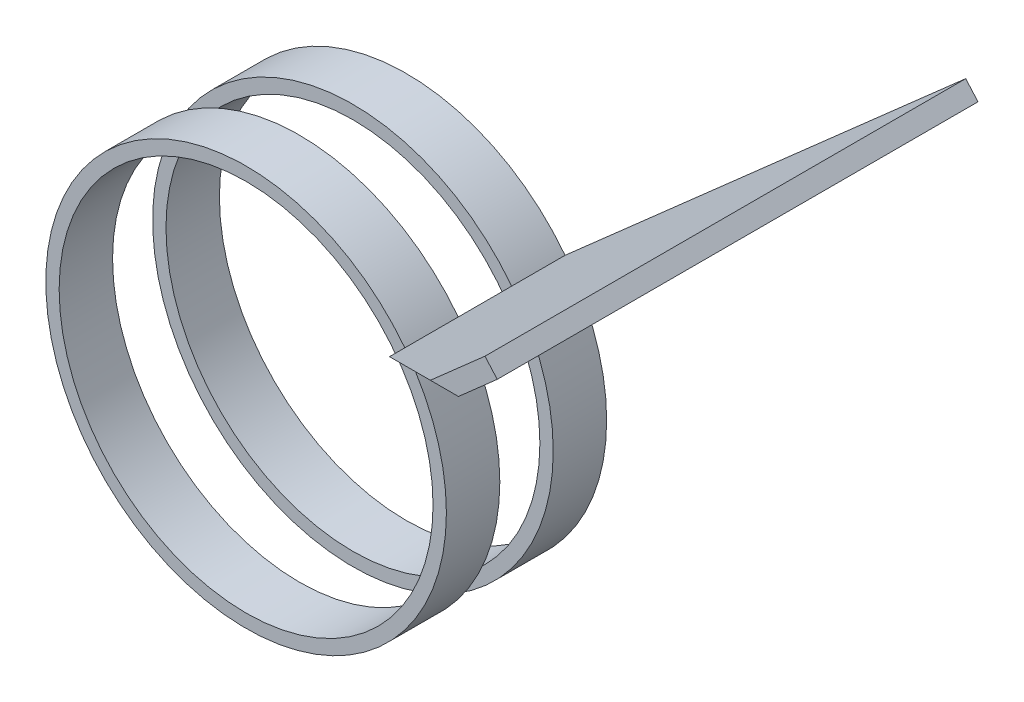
ISO-10303-21;
HEADER;
FILE_DESCRIPTION(('STEP AP214'),'2;1');
FILE_NAME('part.step','',(''),(''),'','','');
FILE_SCHEMA(('AUTOMOTIVE_DESIGN { 1 0 10303 214 1 1 1 1 }'));
ENDSEC;
DATA;
#1=APPLICATION_CONTEXT('core data for automotive mechanical design processes');
#2=APPLICATION_PROTOCOL_DEFINITION('international standard','automotive_design',2000,#1);
#3=PRODUCT_CONTEXT('',#1,'mechanical');
#4=PRODUCT('Part','Part','',(#3));
#5=PRODUCT_RELATED_PRODUCT_CATEGORY('part','',(#4));
#6=PRODUCT_DEFINITION_FORMATION('','',#4);
#7=PRODUCT_DEFINITION_CONTEXT('part definition',#1,'design');
#8=PRODUCT_DEFINITION('design','',#6,#7);
#9=PRODUCT_DEFINITION_SHAPE('','',#8);
#10=(LENGTH_UNIT() NAMED_UNIT(*) SI_UNIT(.MILLI.,.METRE.));
#11=(NAMED_UNIT(*) PLANE_ANGLE_UNIT() SI_UNIT($,.RADIAN.));
#12=(NAMED_UNIT(*) SI_UNIT($,.STERADIAN.) SOLID_ANGLE_UNIT());
#13=UNCERTAINTY_MEASURE_WITH_UNIT(LENGTH_MEASURE(1.E-05),#10,'distance_accuracy_value','');
#14=(GEOMETRIC_REPRESENTATION_CONTEXT(3) GLOBAL_UNCERTAINTY_ASSIGNED_CONTEXT((#13)) GLOBAL_UNIT_ASSIGNED_CONTEXT((#10,
#11,#12)) REPRESENTATION_CONTEXT('',''));
#15=CARTESIAN_POINT('',(0.,0.,0.));
#16=DIRECTION('',(0.,0.,1.));
#17=DIRECTION('',(1.,0.,0.));
#18=AXIS2_PLACEMENT_3D('',#15,#16,#17);
#19=CARTESIAN_POINT('',(0.,0.,10.));
#20=DIRECTION('',(0.,0.,-1.));
#21=DIRECTION('',(-1.,0.,0.));
#22=AXIS2_PLACEMENT_3D('',#19,#20,#21);
#23=CYLINDRICAL_SURFACE('',#22,37.5);
#24=CARTESIAN_POINT('',(0.,0.,10.));
#25=DIRECTION('',(0.,0.,1.));
#26=DIRECTION('',(1.,0.,0.));
#27=AXIS2_PLACEMENT_3D('',#24,#25,#26);
#28=CIRCLE('',#27,37.5);
#29=CARTESIAN_POINT('',(29.7186463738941,22.8703313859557,10.));
#30=VERTEX_POINT('',#29);
#31=CARTESIAN_POINT('',(31.7214438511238,20.,10.));
#32=VERTEX_POINT('',#31);
#33=EDGE_CURVE('E189',#30,#32,#28,.T.);
#34=ORIENTED_EDGE('',*,*,#33,.F.);
#35=DIRECTION('',(0.,0.,1.));
#36=VECTOR('',#35,1.);
#37=CARTESIAN_POINT('',(29.7186463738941,22.8703313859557,-50.));
#38=LINE('',#37,#36);
#39=CARTESIAN_POINT('',(29.7186463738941,22.8703313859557,0.));
#40=VERTEX_POINT('',#39);
#41=EDGE_CURVE('E170',#40,#30,#38,.T.);
#42=ORIENTED_EDGE('',*,*,#41,.F.);
#43=CARTESIAN_POINT('',(0.,0.,0.));
#44=DIRECTION('',(0.,0.,1.));
#45=DIRECTION('',(1.,0.,0.));
#46=AXIS2_PLACEMENT_3D('',#43,#44,#45);
#47=CIRCLE('',#46,37.5);
#48=CARTESIAN_POINT('',(31.7214438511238,20.,0.));
#49=VERTEX_POINT('',#48);
#50=EDGE_CURVE('E185',#40,#49,#47,.T.);
#51=ORIENTED_EDGE('',*,*,#50,.T.);
#52=DIRECTION('',(0.,0.,1.));
#53=VECTOR('',#52,1.);
#54=CARTESIAN_POINT('',(31.7214438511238,20.,-50.));
#55=LINE('',#54,#53);
#56=EDGE_CURVE('E108',#49,#32,#55,.T.);
#57=ORIENTED_EDGE('',*,*,#56,.T.);
#58=EDGE_LOOP('',(#34,#42,#51,#57));
#59=FACE_BOUND('',#58,.T.);
#60=ADVANCED_FACE('F39',(#59),#23,.T.);
#61=CARTESIAN_POINT('',(0.,0.,10.));
#62=DIRECTION('',(0.,0.,1.));
#63=DIRECTION('',(1.,0.,0.));
#64=AXIS2_PLACEMENT_3D('',#61,#62,#63);
#65=PLANE('',#64);
#66=CARTESIAN_POINT('',(0.,0.,10.));
#67=DIRECTION('',(0.,0.,1.));
#68=DIRECTION('',(1.,0.,0.));
#69=AXIS2_PLACEMENT_3D('',#66,#67,#68);
#70=CIRCLE('',#69,35.);
#71=CARTESIAN_POINT('',(35.,0.,10.));
#72=VERTEX_POINT('',#71);
#73=EDGE_CURVE('E180',#72,#72,#70,.T.);
#74=ORIENTED_EDGE('',*,*,#73,.F.);
#75=EDGE_LOOP('',(#74));
#76=FACE_BOUND('',#75,.T.);
#77=DIRECTION('',(0.572227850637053,-0.820094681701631,0.));
#78=VECTOR('',#77,1.);
#79=CARTESIAN_POINT('',(30.720045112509,21.4351656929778,10.));
#80=LINE('',#79,#78);
#81=EDGE_CURVE('E169',#30,#32,#80,.T.);
#82=ORIENTED_EDGE('',*,*,#81,.F.);
#83=ORIENTED_EDGE('',*,*,#33,.T.);
#84=EDGE_LOOP('',(#82,#83));
#85=FACE_BOUND('',#84,.T.);
#86=ADVANCED_FACE('F226',(#76,#85),#65,.T.);
#87=CARTESIAN_POINT('',(0.,0.,0.));
#88=DIRECTION('',(0.,0.,1.));
#89=DIRECTION('',(1.,0.,0.));
#90=AXIS2_PLACEMENT_3D('',#87,#88,#89);
#91=PLANE('',#90);
#92=CARTESIAN_POINT('',(0.,0.,0.));
#93=DIRECTION('',(0.,0.,1.));
#94=DIRECTION('',(1.,0.,0.));
#95=AXIS2_PLACEMENT_3D('',#92,#93,#94);
#96=CIRCLE('',#95,35.);
#97=CARTESIAN_POINT('',(35.,0.,0.));
#98=VERTEX_POINT('',#97);
#99=EDGE_CURVE('E181',#98,#98,#96,.T.);
#100=ORIENTED_EDGE('',*,*,#99,.T.);
#101=EDGE_LOOP('',(#100));
#102=FACE_BOUND('',#101,.T.);
#103=ORIENTED_EDGE('',*,*,#50,.F.);
#104=DIRECTION('',(0.572227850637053,-0.820094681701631,0.));
#105=VECTOR('',#104,1.);
#106=CARTESIAN_POINT('',(30.720045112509,21.4351656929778,0.));
#107=LINE('',#106,#105);
#108=EDGE_CURVE('E193',#40,#49,#107,.T.);
#109=ORIENTED_EDGE('',*,*,#108,.T.);
#110=EDGE_LOOP('',(#103,#109));
#111=FACE_BOUND('',#110,.T.);
#112=ADVANCED_FACE('F228',(#102,#111),#91,.F.);
#113=CARTESIAN_POINT('',(0.,0.,0.));
#114=DIRECTION('',(0.,0.,1.));
#115=DIRECTION('',(1.,0.,0.));
#116=AXIS2_PLACEMENT_3D('',#113,#114,#115);
#117=CYLINDRICAL_SURFACE('',#116,35.);
#118=ORIENTED_EDGE('',*,*,#99,.F.);
#119=EDGE_LOOP('',(#118));
#120=FACE_BOUND('',#119,.T.);
#121=ORIENTED_EDGE('',*,*,#73,.T.);
#122=EDGE_LOOP('',(#121));
#123=FACE_BOUND('',#122,.T.);
#124=ADVANCED_FACE('F235',(#120,#123),#117,.F.);
#125=CARTESIAN_POINT('',(31.7214438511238,20.,-50.));
#126=DIRECTION('',(-0.82009468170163,-0.572227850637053,0.));
#127=DIRECTION('',(0.572227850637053,-0.820094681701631,0.));
#128=AXIS2_PLACEMENT_3D('',#125,#126,#127);
#129=PLANE('',#128);
#130=DIRECTION('',(-0.572227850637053,0.820094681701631,0.));
#131=VECTOR('',#130,1.);
#132=CARTESIAN_POINT('',(31.7214438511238,20.,-10.));
#133=LINE('',#132,#131);
#134=CARTESIAN_POINT('',(31.7214438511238,20.,-10.));
#135=VERTEX_POINT('',#134);
#136=CARTESIAN_POINT('',(29.7186463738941,22.8703313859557,-10.));
#137=VERTEX_POINT('',#136);
#138=EDGE_CURVE('E113',#135,#137,#133,.T.);
#139=ORIENTED_EDGE('',*,*,#138,.F.);
#140=EDGE_CURVE('E101',#135,#49,#55,.T.);
#141=ORIENTED_EDGE('',*,*,#140,.T.);
#142=ORIENTED_EDGE('',*,*,#108,.F.);
#143=EDGE_CURVE('E54',#137,#40,#38,.T.);
#144=ORIENTED_EDGE('',*,*,#143,.F.);
#145=EDGE_LOOP('',(#139,#141,#142,#144));
#146=FACE_BOUND('',#145,.T.);
#147=ADVANCED_FACE('F114',(#146),#129,.T.);
#148=DIRECTION('',(0.442464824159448,-0.634123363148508,-0.634123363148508));
#149=VECTOR('',#148,1.);
#150=CARTESIAN_POINT('',(48.556080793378,-4.12674638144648,-14.1267463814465));
#151=LINE('',#150,#149);
#152=CARTESIAN_POINT('',(29.7186463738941,22.8703313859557,12.8703313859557));
#153=VERTEX_POINT('',#152);
#154=EDGE_CURVE('E148',#153,#32,#151,.T.);
#155=ORIENTED_EDGE('',*,*,#154,.F.);
#156=EDGE_CURVE('E174',#30,#153,#38,.T.);
#157=ORIENTED_EDGE('',*,*,#156,.F.);
#158=ORIENTED_EDGE('',*,*,#81,.T.);
#159=EDGE_LOOP('',(#155,#157,#158));
#160=FACE_BOUND('',#159,.T.);
#161=ADVANCED_FACE('F218',(#160),#129,.T.);
#162=CARTESIAN_POINT('',(29.7186463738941,22.8703313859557,-50.));
#163=DIRECTION('',(-0.661437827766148,0.75,0.));
#164=DIRECTION('',(-0.75,-0.661437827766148,0.));
#165=AXIS2_PLACEMENT_3D('',#162,#163,#164);
#166=PLANE('',#165);
#167=DIRECTION('',(0.75,0.661437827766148,0.));
#168=VECTOR('',#167,1.);
#169=CARTESIAN_POINT('',(29.7186463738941,22.8703313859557,-20.));
#170=LINE('',#169,#168);
#171=CARTESIAN_POINT('',(29.7186463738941,22.8703313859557,-20.));
#172=VERTEX_POINT('',#171);
#173=CARTESIAN_POINT('',(104.718646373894,89.0141141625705,-20.));
#174=VERTEX_POINT('',#173);
#175=EDGE_CURVE('E142',#172,#174,#170,.T.);
#176=ORIENTED_EDGE('',*,*,#175,.F.);
#177=EDGE_CURVE('E166',#172,#137,#38,.T.);
#178=ORIENTED_EDGE('',*,*,#177,.T.);
#179=ORIENTED_EDGE('',*,*,#143,.T.);
#180=ORIENTED_EDGE('',*,*,#41,.T.);
#181=ORIENTED_EDGE('',*,*,#156,.T.);
#182=DIRECTION('',(-0.625543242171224,-0.551677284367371,-0.551677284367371));
#183=VECTOR('',#182,1.);
#184=CARTESIAN_POINT('',(8.02222093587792,3.73588270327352,-6.26411729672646));
#185=LINE('',#184,#183);
#186=CARTESIAN_POINT('',(94.4976016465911,80.,70.));
#187=VERTEX_POINT('',#186);
#188=EDGE_CURVE('E151',#187,#153,#185,.T.);
#189=ORIENTED_EDGE('',*,*,#188,.F.);
#190=DIRECTION('',(-0.75,-0.661437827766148,0.));
#191=VECTOR('',#190,1.);
#192=CARTESIAN_POINT('',(29.7186463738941,22.8703313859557,70.));
#193=LINE('',#192,#191);
#194=CARTESIAN_POINT('',(104.718646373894,89.0141141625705,70.));
#195=VERTEX_POINT('',#194);
#196=EDGE_CURVE('E162',#195,#187,#193,.T.);
#197=ORIENTED_EDGE('',*,*,#196,.F.);
#198=DIRECTION('',(0.,0.,1.));
#199=VECTOR('',#198,1.);
#200=CARTESIAN_POINT('',(104.718646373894,89.0141141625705,-50.));
#201=LINE('',#200,#199);
#202=EDGE_CURVE('E171',#174,#195,#201,.T.);
#203=ORIENTED_EDGE('',*,*,#202,.F.);
#204=EDGE_LOOP('',(#176,#178,#179,#180,#181,#189,#197,#203));
#205=FACE_BOUND('',#204,.T.);
#206=ADVANCED_FACE('F212',(#205),#166,.T.);
#207=CARTESIAN_POINT('',(104.718646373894,89.0141141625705,-50.));
#208=DIRECTION('',(0.749999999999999,0.661437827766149,0.));
#209=DIRECTION('',(-0.661437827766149,0.749999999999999,0.));
#210=AXIS2_PLACEMENT_3D('',#207,#208,#209);
#211=PLANE('',#210);
#212=DIRECTION('',(0.661437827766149,-0.749999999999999,0.));
#213=VECTOR('',#212,1.);
#214=CARTESIAN_POINT('',(104.718646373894,89.0141141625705,-20.));
#215=LINE('',#214,#213);
#216=CARTESIAN_POINT('',(107.018779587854,86.4060082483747,-20.));
#217=VERTEX_POINT('',#216);
#218=EDGE_CURVE('E61',#174,#217,#215,.T.);
#219=ORIENTED_EDGE('',*,*,#218,.F.);
#220=ORIENTED_EDGE('',*,*,#202,.T.);
#221=DIRECTION('',(-0.661437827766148,0.749999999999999,0.));
#222=VECTOR('',#221,1.);
#223=CARTESIAN_POINT('',(104.718646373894,89.0141141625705,70.));
#224=LINE('',#223,#222);
#225=CARTESIAN_POINT('',(107.018779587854,86.4060082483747,70.));
#226=VERTEX_POINT('',#225);
#227=EDGE_CURVE('E158',#226,#195,#224,.T.);
#228=ORIENTED_EDGE('',*,*,#227,.F.);
#229=DIRECTION('',(0.,0.,1.));
#230=VECTOR('',#229,1.);
#231=CARTESIAN_POINT('',(107.018779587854,86.4060082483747,-50.));
#232=LINE('',#231,#230);
#233=EDGE_CURVE('E127',#217,#226,#232,.T.);
#234=ORIENTED_EDGE('',*,*,#233,.F.);
#235=EDGE_LOOP('',(#219,#220,#228,#234));
#236=FACE_BOUND('',#235,.T.);
#237=ADVANCED_FACE('F209',(#236),#211,.T.);
#238=CARTESIAN_POINT('',(107.018779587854,86.4060082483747,-50.));
#239=DIRECTION('',(0.661437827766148,-0.75,0.));
#240=DIRECTION('',(0.75,0.661437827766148,0.));
#241=AXIS2_PLACEMENT_3D('',#238,#239,#240);
#242=PLANE('',#241);
#243=DIRECTION('',(-0.75,-0.661437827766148,0.));
#244=VECTOR('',#243,1.);
#245=CARTESIAN_POINT('',(107.018779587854,86.4060082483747,-20.));
#246=LINE('',#245,#244);
#247=CARTESIAN_POINT('',(31.7214438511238,20.,-20.));
#248=VERTEX_POINT('',#247);
#249=EDGE_CURVE('E11',#217,#248,#246,.T.);
#250=ORIENTED_EDGE('',*,*,#249,.F.);
#251=ORIENTED_EDGE('',*,*,#233,.T.);
#252=DIRECTION('',(0.75,0.661437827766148,0.));
#253=VECTOR('',#252,1.);
#254=CARTESIAN_POINT('',(107.018779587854,86.4060082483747,70.));
#255=LINE('',#254,#253);
#256=CARTESIAN_POINT('',(99.7550489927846,80.,70.));
#257=VERTEX_POINT('',#256);
#258=EDGE_CURVE('E154',#257,#226,#255,.T.);
#259=ORIENTED_EDGE('',*,*,#258,.F.);
#260=DIRECTION('',(0.625543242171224,0.551677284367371,0.551677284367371));
#261=VECTOR('',#260,1.);
#262=CARTESIAN_POINT('',(63.3963193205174,47.9346144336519,37.9346144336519));
#263=LINE('',#262,#261);
#264=EDGE_CURVE('E145',#32,#257,#263,.T.);
#265=ORIENTED_EDGE('',*,*,#264,.F.);
#266=ORIENTED_EDGE('',*,*,#56,.F.);
#267=ORIENTED_EDGE('',*,*,#140,.F.);
#268=EDGE_CURVE('E104',#248,#135,#55,.T.);
#269=ORIENTED_EDGE('',*,*,#268,.F.);
#270=EDGE_LOOP('',(#250,#251,#259,#265,#266,#267,#269));
#271=FACE_BOUND('',#270,.T.);
#272=ADVANCED_FACE('F102',(#271),#242,.T.);
#273=CARTESIAN_POINT('',(0.,0.,70.));
#274=DIRECTION('',(0.,0.,-1.));
#275=DIRECTION('',(-1.,0.,0.));
#276=AXIS2_PLACEMENT_3D('',#273,#274,#275);
#277=PLANE('',#276);
#278=ORIENTED_EDGE('',*,*,#196,.T.);
#279=DIRECTION('',(1.,0.,0.));
#280=VECTOR('',#279,1.);
#281=CARTESIAN_POINT('',(0.,80.,70.));
#282=LINE('',#281,#280);
#283=EDGE_CURVE('E47',#187,#257,#282,.T.);
#284=ORIENTED_EDGE('',*,*,#283,.T.);
#285=ORIENTED_EDGE('',*,*,#258,.T.);
#286=ORIENTED_EDGE('',*,*,#227,.T.);
#287=EDGE_LOOP('',(#278,#284,#285,#286));
#288=FACE_BOUND('',#287,.T.);
#289=ADVANCED_FACE('F202',(#288),#277,.F.);
#290=CARTESIAN_POINT('',(7.01877958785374,20.,10.));
#291=DIRECTION('',(0.,0.707106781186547,-0.707106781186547));
#292=DIRECTION('',(0.,0.707106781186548,0.707106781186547));
#293=AXIS2_PLACEMENT_3D('',#290,#291,#292);
#294=PLANE('',#293);
#295=ORIENTED_EDGE('',*,*,#188,.T.);
#296=ORIENTED_EDGE('',*,*,#154,.T.);
#297=ORIENTED_EDGE('',*,*,#264,.T.);
#298=ORIENTED_EDGE('',*,*,#283,.F.);
#299=EDGE_LOOP('',(#295,#296,#297,#298));
#300=FACE_BOUND('',#299,.T.);
#301=ADVANCED_FACE('F216',(#300),#294,.F.);
#302=CARTESIAN_POINT('',(7.01877958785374,20.,-20.));
#303=DIRECTION('',(0.,0.,1.));
#304=DIRECTION('',(0.,-1.,0.));
#305=AXIS2_PLACEMENT_3D('',#302,#303,#304);
#306=PLANE('',#305);
#307=CARTESIAN_POINT('',(0.,0.,-20.));
#308=DIRECTION('',(0.,0.,1.));
#309=DIRECTION('',(1.,0.,0.));
#310=AXIS2_PLACEMENT_3D('',#307,#308,#309);
#311=CIRCLE('',#310,35.);
#312=CARTESIAN_POINT('',(35.,0.,-20.));
#313=VERTEX_POINT('',#312);
#314=EDGE_CURVE('E130',#313,#313,#311,.T.);
#315=ORIENTED_EDGE('',*,*,#314,.T.);
#316=EDGE_LOOP('',(#315));
#317=FACE_BOUND('',#316,.T.);
#318=ORIENTED_EDGE('',*,*,#249,.T.);
#319=CARTESIAN_POINT('',(0.,0.,-20.));
#320=DIRECTION('',(0.,0.,1.));
#321=DIRECTION('',(1.,0.,0.));
#322=AXIS2_PLACEMENT_3D('',#319,#320,#321);
#323=CIRCLE('',#322,37.5);
#324=EDGE_CURVE('E119',#172,#248,#323,.T.);
#325=ORIENTED_EDGE('',*,*,#324,.F.);
#326=ORIENTED_EDGE('',*,*,#175,.T.);
#327=ORIENTED_EDGE('',*,*,#218,.T.);
#328=EDGE_LOOP('',(#318,#325,#326,#327));
#329=FACE_BOUND('',#328,.T.);
#330=ADVANCED_FACE('F254',(#317,#329),#306,.F.);
#331=CARTESIAN_POINT('',(0.,0.,-20.));
#332=DIRECTION('',(0.,0.,1.));
#333=DIRECTION('',(1.,0.,0.));
#334=AXIS2_PLACEMENT_3D('',#331,#332,#333);
#335=CYLINDRICAL_SURFACE('',#334,37.5);
#336=CARTESIAN_POINT('',(0.,0.,-10.));
#337=DIRECTION('',(0.,0.,1.));
#338=DIRECTION('',(1.,0.,0.));
#339=AXIS2_PLACEMENT_3D('',#336,#337,#338);
#340=CIRCLE('',#339,37.5);
#341=EDGE_CURVE('E124',#137,#135,#340,.T.);
#342=ORIENTED_EDGE('',*,*,#341,.F.);
#343=ORIENTED_EDGE('',*,*,#177,.F.);
#344=ORIENTED_EDGE('',*,*,#324,.T.);
#345=ORIENTED_EDGE('',*,*,#268,.T.);
#346=EDGE_LOOP('',(#342,#343,#344,#345));
#347=FACE_BOUND('',#346,.T.);
#348=ADVANCED_FACE('F122',(#347),#335,.T.);
#349=CARTESIAN_POINT('',(0.,0.,-10.));
#350=DIRECTION('',(0.,0.,1.));
#351=DIRECTION('',(1.,0.,0.));
#352=AXIS2_PLACEMENT_3D('',#349,#350,#351);
#353=PLANE('',#352);
#354=CARTESIAN_POINT('',(0.,0.,-10.));
#355=DIRECTION('',(0.,0.,1.));
#356=DIRECTION('',(1.,0.,0.));
#357=AXIS2_PLACEMENT_3D('',#354,#355,#356);
#358=CIRCLE('',#357,35.);
#359=CARTESIAN_POINT('',(35.,0.,-10.));
#360=VERTEX_POINT('',#359);
#361=EDGE_CURVE('E136',#360,#360,#358,.T.);
#362=ORIENTED_EDGE('',*,*,#361,.F.);
#363=EDGE_LOOP('',(#362));
#364=FACE_BOUND('',#363,.T.);
#365=ORIENTED_EDGE('',*,*,#341,.T.);
#366=ORIENTED_EDGE('',*,*,#138,.T.);
#367=EDGE_LOOP('',(#365,#366));
#368=FACE_BOUND('',#367,.T.);
#369=ADVANCED_FACE('F128',(#364,#368),#353,.T.);
#370=CARTESIAN_POINT('',(0.,0.,-20.));
#371=DIRECTION('',(0.,0.,1.));
#372=DIRECTION('',(1.,0.,0.));
#373=AXIS2_PLACEMENT_3D('',#370,#371,#372);
#374=CYLINDRICAL_SURFACE('',#373,35.);
#375=ORIENTED_EDGE('',*,*,#314,.F.);
#376=EDGE_LOOP('',(#375));
#377=FACE_BOUND('',#376,.T.);
#378=ORIENTED_EDGE('',*,*,#361,.T.);
#379=EDGE_LOOP('',(#378));
#380=FACE_BOUND('',#379,.T.);
#381=ADVANCED_FACE('F262',(#377,#380),#374,.F.);
#382=CLOSED_SHELL('',(#60,#86,#112,#124,#147,#161,#206,#237,#272,#289,#301,#330,#348,#369,#381));
#383=MANIFOLD_SOLID_BREP('B2',#382);
#384=ADVANCED_BREP_SHAPE_REPRESENTATION('',(#18,#383),#14);
#385=SHAPE_DEFINITION_REPRESENTATION(#9,#384);
ENDSEC;
END-ISO-10303-21;
